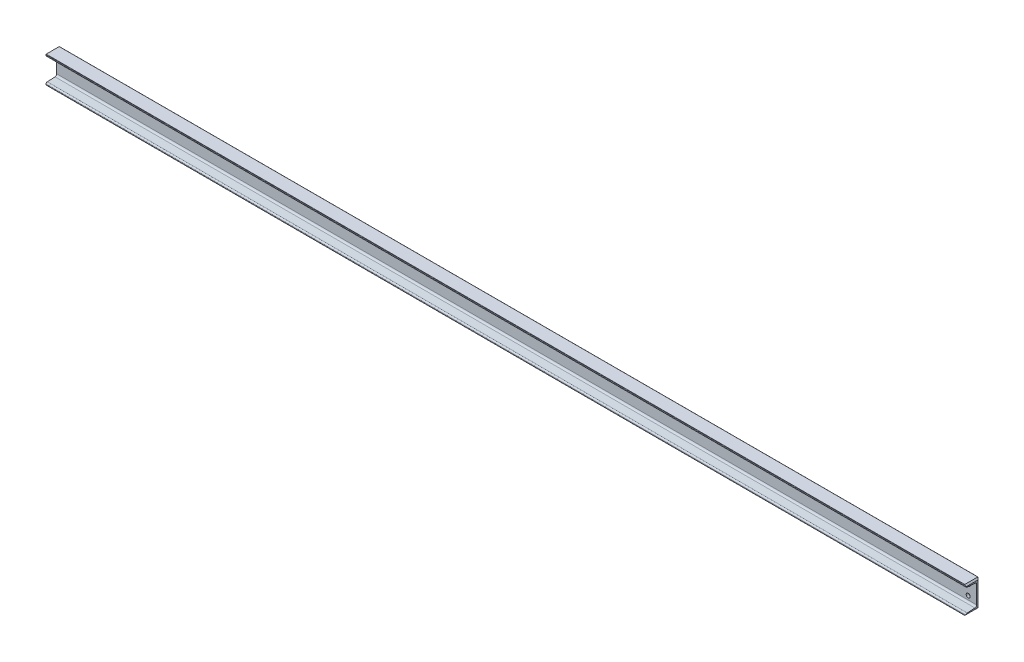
ISO-10303-21;
HEADER;
FILE_DESCRIPTION(('STEP AP214'),'2;1');
FILE_NAME('part.step','',(''),(''),'','','');
FILE_SCHEMA(('AUTOMOTIVE_DESIGN { 1 0 10303 214 1 1 1 1 }'));
ENDSEC;
DATA;
#1=APPLICATION_CONTEXT('core data for automotive mechanical design processes');
#2=APPLICATION_PROTOCOL_DEFINITION('international standard','automotive_design',2000,#1);
#3=PRODUCT_CONTEXT('',#1,'mechanical');
#4=PRODUCT('Part','Part','',(#3));
#5=PRODUCT_RELATED_PRODUCT_CATEGORY('part','',(#4));
#6=PRODUCT_DEFINITION_FORMATION('','',#4);
#7=PRODUCT_DEFINITION_CONTEXT('part definition',#1,'design');
#8=PRODUCT_DEFINITION('design','',#6,#7);
#9=PRODUCT_DEFINITION_SHAPE('','',#8);
#10=(LENGTH_UNIT() NAMED_UNIT(*) SI_UNIT(.MILLI.,.METRE.));
#11=(NAMED_UNIT(*) PLANE_ANGLE_UNIT() SI_UNIT($,.RADIAN.));
#12=(NAMED_UNIT(*) SI_UNIT($,.STERADIAN.) SOLID_ANGLE_UNIT());
#13=UNCERTAINTY_MEASURE_WITH_UNIT(LENGTH_MEASURE(1.E-05),#10,'distance_accuracy_value','');
#14=(GEOMETRIC_REPRESENTATION_CONTEXT(3) GLOBAL_UNCERTAINTY_ASSIGNED_CONTEXT((#13)) GLOBAL_UNIT_ASSIGNED_CONTEXT((#10,
#11,#12)) REPRESENTATION_CONTEXT('',''));
#15=CARTESIAN_POINT('',(0.,0.,0.));
#16=DIRECTION('',(0.,0.,1.));
#17=DIRECTION('',(1.,0.,0.));
#18=AXIS2_PLACEMENT_3D('',#15,#16,#17);
#19=CARTESIAN_POINT('',(0.,0.,30.));
#20=DIRECTION('',(0.,0.,1.));
#21=DIRECTION('',(1.,0.,0.));
#22=AXIS2_PLACEMENT_3D('',#19,#20,#21);
#23=PLANE('',#22);
#24=DIRECTION('',(-0.7071067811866,-0.707106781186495,0.));
#25=VECTOR('',#24,1.);
#26=CARTESIAN_POINT('',(528.499999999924,-528.500000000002,30.));
#27=LINE('',#26,#25);
#28=CARTESIAN_POINT('',(1027.5,-29.4999999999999,30.));
#29=VERTEX_POINT('',#28);
#30=CARTESIAN_POINT('',(1029.09397946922,-27.906020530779,30.));
#31=VERTEX_POINT('',#30);
#32=EDGE_CURVE('E210',#29,#31,#27,.F.);
#33=ORIENTED_EDGE('',*,*,#32,.T.);
#34=DIRECTION('',(1.,0.,0.));
#35=VECTOR('',#34,1.);
#36=CARTESIAN_POINT('',(-1030.,-27.9060205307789,30.));
#37=LINE('',#36,#35);
#38=CARTESIAN_POINT('',(-1030.,-27.9060205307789,30.));
#39=VERTEX_POINT('',#38);
#40=EDGE_CURVE('E258',#31,#39,#37,.F.);
#41=ORIENTED_EDGE('',*,*,#40,.T.);
#42=DIRECTION('',(0.,-1.,0.));
#43=VECTOR('',#42,1.);
#44=CARTESIAN_POINT('',(-1030.,30.,30.));
#45=LINE('',#44,#43);
#46=CARTESIAN_POINT('',(-1030.,-29.5,30.));
#47=VERTEX_POINT('',#46);
#48=EDGE_CURVE('E305',#39,#47,#45,.T.);
#49=ORIENTED_EDGE('',*,*,#48,.T.);
#50=DIRECTION('',(1.,0.,0.));
#51=VECTOR('',#50,1.);
#52=CARTESIAN_POINT('',(0.,-29.5,30.));
#53=LINE('',#52,#51);
#54=EDGE_CURVE('E216',#47,#29,#53,.T.);
#55=ORIENTED_EDGE('',*,*,#54,.T.);
#56=EDGE_LOOP('',(#33,#41,#49,#55));
#57=FACE_BOUND('',#56,.T.);
#58=ADVANCED_FACE('F35',(#57),#23,.T.);
#59=CARTESIAN_POINT('',(1030.,30.,0.));
#60=DIRECTION('',(0.,1.,0.));
#61=DIRECTION('',(0.,0.,1.));
#62=AXIS2_PLACEMENT_3D('',#59,#60,#61);
#63=PLANE('',#62);
#64=DIRECTION('',(0.,0.,1.));
#65=VECTOR('',#64,1.);
#66=CARTESIAN_POINT('',(-1030.,30.,0.));
#67=LINE('',#66,#65);
#68=CARTESIAN_POINT('',(-1030.,30.,0.500000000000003));
#69=VERTEX_POINT('',#68);
#70=CARTESIAN_POINT('',(-1030.,30.,29.5));
#71=VERTEX_POINT('',#70);
#72=EDGE_CURVE('E195',#69,#71,#67,.T.);
#73=ORIENTED_EDGE('',*,*,#72,.T.);
#74=DIRECTION('',(-1.,0.,0.));
#75=VECTOR('',#74,1.);
#76=CARTESIAN_POINT('',(1030.,30.,29.5));
#77=LINE('',#76,#75);
#78=CARTESIAN_POINT('',(1027.,30.,29.5));
#79=VERTEX_POINT('',#78);
#80=EDGE_CURVE('E243',#71,#79,#77,.F.);
#81=ORIENTED_EDGE('',*,*,#80,.T.);
#82=DIRECTION('',(0.,0.,-1.));
#83=VECTOR('',#82,1.);
#84=CARTESIAN_POINT('',(1027.,30.,0.));
#85=LINE('',#84,#83);
#86=CARTESIAN_POINT('',(1027.,30.,0.500000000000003));
#87=VERTEX_POINT('',#86);
#88=EDGE_CURVE('E204',#79,#87,#85,.T.);
#89=ORIENTED_EDGE('',*,*,#88,.T.);
#90=DIRECTION('',(-1.,0.,0.));
#91=VECTOR('',#90,1.);
#92=CARTESIAN_POINT('',(-1030.,30.,0.500000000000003));
#93=LINE('',#92,#91);
#94=EDGE_CURVE('E240',#87,#69,#93,.T.);
#95=ORIENTED_EDGE('',*,*,#94,.T.);
#96=EDGE_LOOP('',(#73,#81,#89,#95));
#97=FACE_BOUND('',#96,.T.);
#98=ADVANCED_FACE('F333',(#97),#63,.T.);
#99=CARTESIAN_POINT('',(1030.,-30.,0.));
#100=DIRECTION('',(1.,0.,0.));
#101=DIRECTION('',(0.,0.,-1.));
#102=AXIS2_PLACEMENT_3D('',#99,#100,#101);
#103=PLANE('',#102);
#104=DIRECTION('',(0.,-1.,0.));
#105=VECTOR('',#104,1.);
#106=CARTESIAN_POINT('',(1030.,23.8013401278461,6.));
#107=LINE('',#106,#105);
#108=CARTESIAN_POINT('',(1030.,20.0054818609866,6.));
#109=VERTEX_POINT('',#108);
#110=CARTESIAN_POINT('',(1030.,-20.0054818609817,6.));
#111=VERTEX_POINT('',#110);
#112=EDGE_CURVE('E297',#109,#111,#107,.T.);
#113=ORIENTED_EDGE('',*,*,#112,.T.);
#114=CARTESIAN_POINT('',(1030.,-20.0054818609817,10.));
#115=DIRECTION('',(1.,0.,0.));
#116=DIRECTION('',(0.,0.,-1.));
#117=AXIS2_PLACEMENT_3D('',#114,#115,#116);
#118=CIRCLE('',#117,4.);
#119=CARTESIAN_POINT('',(1030.,-24.,9.79065617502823));
#120=VERTEX_POINT('',#119);
#121=EDGE_CURVE('E292',#111,#120,#118,.F.);
#122=ORIENTED_EDGE('',*,*,#121,.T.);
#123=DIRECTION('',(0.,0.0523359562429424,-0.998629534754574));
#124=VECTOR('',#123,1.);
#125=CARTESIAN_POINT('',(1030.,-23.8013401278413,6.));
#126=LINE('',#125,#124);
#127=CARTESIAN_POINT('',(1030.,-24.9101319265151,27.1570078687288));
#128=VERTEX_POINT('',#127);
#129=EDGE_CURVE('E295',#120,#128,#126,.F.);
#130=ORIENTED_EDGE('',*,*,#129,.T.);
#131=CARTESIAN_POINT('',(1030.,-27.9060205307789,27.));
#132=DIRECTION('',(1.,0.,0.));
#133=DIRECTION('',(0.,0.,-1.));
#134=AXIS2_PLACEMENT_3D('',#131,#132,#133);
#135=CIRCLE('',#134,3.);
#136=CARTESIAN_POINT('',(1030.,-26.9999999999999,29.8599172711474));
#137=VERTEX_POINT('',#136);
#138=EDGE_CURVE('E174',#128,#137,#135,.T.);
#139=ORIENTED_EDGE('',*,*,#138,.T.);
#140=DIRECTION('',(0.,0.,-1.));
#141=VECTOR('',#140,1.);
#142=CARTESIAN_POINT('',(1030.,-26.9999999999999,0.));
#143=LINE('',#142,#141);
#144=CARTESIAN_POINT('',(1030.,-26.9999999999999,3.00000000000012));
#145=VERTEX_POINT('',#144);
#146=EDGE_CURVE('E165',#137,#145,#143,.T.);
#147=ORIENTED_EDGE('',*,*,#146,.T.);
#148=DIRECTION('',(0.,1.,0.));
#149=VECTOR('',#148,1.);
#150=CARTESIAN_POINT('',(1030.,30.,3.00000000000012));
#151=LINE('',#150,#149);
#152=CARTESIAN_POINT('',(1030.,26.9999999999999,3.00000000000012));
#153=VERTEX_POINT('',#152);
#154=EDGE_CURVE('E171',#145,#153,#151,.T.);
#155=ORIENTED_EDGE('',*,*,#154,.T.);
#156=DIRECTION('',(0.,0.,1.));
#157=VECTOR('',#156,1.);
#158=CARTESIAN_POINT('',(1030.,26.9999999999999,0.));
#159=LINE('',#158,#157);
#160=CARTESIAN_POINT('',(1030.,26.9999999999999,29.8599172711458));
#161=VERTEX_POINT('',#160);
#162=EDGE_CURVE('E177',#153,#161,#159,.T.);
#163=ORIENTED_EDGE('',*,*,#162,.T.);
#164=CARTESIAN_POINT('',(1030.,27.9060205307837,27.));
#165=DIRECTION('',(1.,0.,0.));
#166=DIRECTION('',(0.,0.,-1.));
#167=AXIS2_PLACEMENT_3D('',#164,#165,#166);
#168=CIRCLE('',#167,3.);
#169=CARTESIAN_POINT('',(1030.,24.91013192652,27.1570078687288));
#170=VERTEX_POINT('',#169);
#171=EDGE_CURVE('E269',#161,#170,#168,.T.);
#172=ORIENTED_EDGE('',*,*,#171,.T.);
#173=DIRECTION('',(0.,0.0523359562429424,0.998629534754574));
#174=VECTOR('',#173,1.);
#175=CARTESIAN_POINT('',(1030.,23.8013401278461,6.));
#176=LINE('',#175,#174);
#177=CARTESIAN_POINT('',(1030.,24.0000000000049,9.79065617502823));
#178=VERTEX_POINT('',#177);
#179=EDGE_CURVE('E198',#170,#178,#176,.F.);
#180=ORIENTED_EDGE('',*,*,#179,.T.);
#181=CARTESIAN_POINT('',(1030.,20.0054818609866,10.));
#182=DIRECTION('',(1.,0.,0.));
#183=DIRECTION('',(0.,0.,-1.));
#184=AXIS2_PLACEMENT_3D('',#181,#182,#183);
#185=CIRCLE('',#184,4.);
#186=EDGE_CURVE('E11',#178,#109,#185,.F.);
#187=ORIENTED_EDGE('',*,*,#186,.T.);
#188=EDGE_LOOP('',(#113,#122,#130,#139,#147,#155,#163,#172,#180,#187));
#189=FACE_BOUND('',#188,.T.);
#190=ADVANCED_FACE('F168',(#189),#103,.T.);
#191=CARTESIAN_POINT('',(-1030.,-30.,0.));
#192=DIRECTION('',(0.,-1.,0.));
#193=DIRECTION('',(0.,0.,-1.));
#194=AXIS2_PLACEMENT_3D('',#191,#192,#193);
#195=PLANE('',#194);
#196=DIRECTION('',(0.,0.,1.));
#197=VECTOR('',#196,1.);
#198=CARTESIAN_POINT('',(1027.,-30.,0.));
#199=LINE('',#198,#197);
#200=CARTESIAN_POINT('',(1027.,-30.,0.500000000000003));
#201=VERTEX_POINT('',#200);
#202=CARTESIAN_POINT('',(1027.,-30.,29.5));
#203=VERTEX_POINT('',#202);
#204=EDGE_CURVE('E207',#201,#203,#199,.T.);
#205=ORIENTED_EDGE('',*,*,#204,.T.);
#206=DIRECTION('',(1.,0.,0.));
#207=VECTOR('',#206,1.);
#208=CARTESIAN_POINT('',(-1030.,-30.,29.5));
#209=LINE('',#208,#207);
#210=CARTESIAN_POINT('',(-1030.,-30.,29.5));
#211=VERTEX_POINT('',#210);
#212=EDGE_CURVE('E226',#203,#211,#209,.F.);
#213=ORIENTED_EDGE('',*,*,#212,.T.);
#214=DIRECTION('',(0.,0.,1.));
#215=VECTOR('',#214,1.);
#216=CARTESIAN_POINT('',(-1030.,-30.,0.));
#217=LINE('',#216,#215);
#218=CARTESIAN_POINT('',(-1030.,-30.,0.500000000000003));
#219=VERTEX_POINT('',#218);
#220=EDGE_CURVE('E192',#219,#211,#217,.T.);
#221=ORIENTED_EDGE('',*,*,#220,.F.);
#222=DIRECTION('',(1.,0.,0.));
#223=VECTOR('',#222,1.);
#224=CARTESIAN_POINT('',(1027.,-30.,0.500000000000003));
#225=LINE('',#224,#223);
#226=EDGE_CURVE('E223',#219,#201,#225,.T.);
#227=ORIENTED_EDGE('',*,*,#226,.T.);
#228=EDGE_LOOP('',(#205,#213,#221,#227));
#229=FACE_BOUND('',#228,.T.);
#230=ADVANCED_FACE('F361',(#229),#195,.T.);
#231=CARTESIAN_POINT('',(-1030.,30.,0.));
#232=DIRECTION('',(-1.,0.,0.));
#233=DIRECTION('',(0.,0.,1.));
#234=AXIS2_PLACEMENT_3D('',#231,#232,#233);
#235=PLANE('',#234);
#236=ORIENTED_EDGE('',*,*,#48,.F.);
#237=CARTESIAN_POINT('',(-1030.,-27.9060205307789,27.));
#238=DIRECTION('',(-1.,0.,0.));
#239=DIRECTION('',(0.,0.,1.));
#240=AXIS2_PLACEMENT_3D('',#237,#238,#239);
#241=CIRCLE('',#240,3.);
#242=CARTESIAN_POINT('',(-1030.,-24.9101319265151,27.1570078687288));
#243=VERTEX_POINT('',#242);
#244=EDGE_CURVE('E263',#39,#243,#241,.T.);
#245=ORIENTED_EDGE('',*,*,#244,.T.);
#246=DIRECTION('',(0.,0.0523359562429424,-0.998629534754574));
#247=VECTOR('',#246,1.);
#248=CARTESIAN_POINT('',(-1030.,-23.3403900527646,-2.79545138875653));
#249=LINE('',#248,#247);
#250=CARTESIAN_POINT('',(-1030.,-24.,9.79065617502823));
#251=VERTEX_POINT('',#250);
#252=EDGE_CURVE('E312',#251,#243,#249,.F.);
#253=ORIENTED_EDGE('',*,*,#252,.F.);
#254=CARTESIAN_POINT('',(-1030.,-20.0054818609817,10.));
#255=DIRECTION('',(-1.,0.,0.));
#256=DIRECTION('',(0.,0.,1.));
#257=AXIS2_PLACEMENT_3D('',#254,#255,#256);
#258=CIRCLE('',#257,4.);
#259=CARTESIAN_POINT('',(-1030.,-20.0054818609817,6.));
#260=VERTEX_POINT('',#259);
#261=EDGE_CURVE('E290',#251,#260,#258,.F.);
#262=ORIENTED_EDGE('',*,*,#261,.T.);
#263=DIRECTION('',(0.,-1.,0.));
#264=VECTOR('',#263,1.);
#265=CARTESIAN_POINT('',(-1030.,23.8013401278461,6.));
#266=LINE('',#265,#264);
#267=CARTESIAN_POINT('',(-1030.,20.0054818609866,6.));
#268=VERTEX_POINT('',#267);
#269=EDGE_CURVE('E311',#268,#260,#266,.T.);
#270=ORIENTED_EDGE('',*,*,#269,.F.);
#271=CARTESIAN_POINT('',(-1030.,20.0054818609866,10.));
#272=DIRECTION('',(-1.,0.,0.));
#273=DIRECTION('',(0.,0.,1.));
#274=AXIS2_PLACEMENT_3D('',#271,#272,#273);
#275=CIRCLE('',#274,4.);
#276=CARTESIAN_POINT('',(-1030.,24.0000000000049,9.79065617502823));
#277=VERTEX_POINT('',#276);
#278=EDGE_CURVE('E43',#268,#277,#275,.F.);
#279=ORIENTED_EDGE('',*,*,#278,.T.);
#280=DIRECTION('',(0.,0.0523359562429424,0.998629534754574));
#281=VECTOR('',#280,1.);
#282=CARTESIAN_POINT('',(-1030.,23.5047331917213,0.340402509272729));
#283=LINE('',#282,#281);
#284=CARTESIAN_POINT('',(-1030.,24.91013192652,27.1570078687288));
#285=VERTEX_POINT('',#284);
#286=EDGE_CURVE('E316',#285,#277,#283,.F.);
#287=ORIENTED_EDGE('',*,*,#286,.F.);
#288=CARTESIAN_POINT('',(-1030.,27.9060205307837,27.));
#289=DIRECTION('',(-1.,0.,0.));
#290=DIRECTION('',(0.,0.,1.));
#291=AXIS2_PLACEMENT_3D('',#288,#289,#290);
#292=CIRCLE('',#291,3.);
#293=CARTESIAN_POINT('',(-1030.,27.9060205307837,30.));
#294=VERTEX_POINT('',#293);
#295=EDGE_CURVE('E261',#285,#294,#292,.T.);
#296=ORIENTED_EDGE('',*,*,#295,.T.);
#297=CARTESIAN_POINT('',(-1030.,29.5,30.));
#298=VERTEX_POINT('',#297);
#299=EDGE_CURVE('E326',#298,#294,#45,.T.);
#300=ORIENTED_EDGE('',*,*,#299,.F.);
#301=CARTESIAN_POINT('',(-1030.,29.5,29.5));
#302=DIRECTION('',(-1.,0.,0.));
#303=DIRECTION('',(0.,0.,1.));
#304=AXIS2_PLACEMENT_3D('',#301,#302,#303);
#305=CIRCLE('',#304,0.5);
#306=EDGE_CURVE('E232',#298,#71,#305,.T.);
#307=ORIENTED_EDGE('',*,*,#306,.T.);
#308=ORIENTED_EDGE('',*,*,#72,.F.);
#309=CARTESIAN_POINT('',(-1030.,29.5,0.500000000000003));
#310=DIRECTION('',(-1.,0.,0.));
#311=DIRECTION('',(0.,0.,1.));
#312=AXIS2_PLACEMENT_3D('',#309,#310,#311);
#313=CIRCLE('',#312,0.5);
#314=CARTESIAN_POINT('',(-1030.,29.5,0.));
#315=VERTEX_POINT('',#314);
#316=EDGE_CURVE('E228',#69,#315,#313,.T.);
#317=ORIENTED_EDGE('',*,*,#316,.T.);
#318=DIRECTION('',(0.,-1.,0.));
#319=VECTOR('',#318,1.);
#320=CARTESIAN_POINT('',(-1030.,30.,0.));
#321=LINE('',#320,#319);
#322=CARTESIAN_POINT('',(-1030.,-29.5,0.));
#323=VERTEX_POINT('',#322);
#324=EDGE_CURVE('E323',#315,#323,#321,.T.);
#325=ORIENTED_EDGE('',*,*,#324,.T.);
#326=CARTESIAN_POINT('',(-1030.,-29.5,0.500000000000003));
#327=DIRECTION('',(-1.,0.,0.));
#328=DIRECTION('',(0.,0.,1.));
#329=AXIS2_PLACEMENT_3D('',#326,#327,#328);
#330=CIRCLE('',#329,0.5);
#331=EDGE_CURVE('E230',#323,#219,#330,.T.);
#332=ORIENTED_EDGE('',*,*,#331,.T.);
#333=ORIENTED_EDGE('',*,*,#220,.T.);
#334=CARTESIAN_POINT('',(-1030.,-29.5,29.5));
#335=DIRECTION('',(-1.,0.,0.));
#336=DIRECTION('',(0.,0.,1.));
#337=AXIS2_PLACEMENT_3D('',#334,#335,#336);
#338=CIRCLE('',#337,0.5);
#339=EDGE_CURVE('E234',#211,#47,#338,.T.);
#340=ORIENTED_EDGE('',*,*,#339,.T.);
#341=EDGE_LOOP('',(#236,#245,#253,#262,#270,#279,#287,#296,#300,#307,#308,#317,#325,#332,#333,#340));
#342=FACE_BOUND('',#341,.T.);
#343=ADVANCED_FACE('F310',(#342),#235,.T.);
#344=CARTESIAN_POINT('',(0.,0.,0.));
#345=DIRECTION('',(0.,0.,1.));
#346=DIRECTION('',(1.,0.,0.));
#347=AXIS2_PLACEMENT_3D('',#344,#345,#346);
#348=PLANE('',#347);
#349=CARTESIAN_POINT('',(1011.,-11.25,0.));
#350=DIRECTION('',(0.,0.,1.));
#351=DIRECTION('',(1.,0.,0.));
#352=AXIS2_PLACEMENT_3D('',#349,#350,#351);
#353=CIRCLE('',#352,4.49999999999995);
#354=CARTESIAN_POINT('',(1015.5,-11.25,0.));
#355=VERTEX_POINT('',#354);
#356=EDGE_CURVE('E566',#355,#355,#353,.T.);
#357=ORIENTED_EDGE('',*,*,#356,.T.);
#358=EDGE_LOOP('',(#357));
#359=FACE_BOUND('',#358,.T.);
#360=CARTESIAN_POINT('',(1011.,11.25,0.));
#361=DIRECTION('',(0.,0.,1.));
#362=DIRECTION('',(1.,0.,0.));
#363=AXIS2_PLACEMENT_3D('',#360,#361,#362);
#364=CIRCLE('',#363,4.49999999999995);
#365=CARTESIAN_POINT('',(1015.5,11.25,0.));
#366=VERTEX_POINT('',#365);
#367=EDGE_CURVE('E319',#366,#366,#364,.T.);
#368=ORIENTED_EDGE('',*,*,#367,.T.);
#369=EDGE_LOOP('',(#368));
#370=FACE_BOUND('',#369,.T.);
#371=DIRECTION('',(0.,-1.,0.));
#372=VECTOR('',#371,1.);
#373=CARTESIAN_POINT('',(1027.,-30.,0.));
#374=LINE('',#373,#372);
#375=CARTESIAN_POINT('',(1027.,29.5,0.));
#376=VERTEX_POINT('',#375);
#377=CARTESIAN_POINT('',(1027.,-29.5,0.));
#378=VERTEX_POINT('',#377);
#379=EDGE_CURVE('E213',#376,#378,#374,.T.);
#380=ORIENTED_EDGE('',*,*,#379,.T.);
#381=DIRECTION('',(1.,0.,0.));
#382=VECTOR('',#381,1.);
#383=CARTESIAN_POINT('',(-1030.,-29.5,0.));
#384=LINE('',#383,#382);
#385=EDGE_CURVE('E256',#378,#323,#384,.F.);
#386=ORIENTED_EDGE('',*,*,#385,.T.);
#387=ORIENTED_EDGE('',*,*,#324,.F.);
#388=DIRECTION('',(-1.,0.,0.));
#389=VECTOR('',#388,1.);
#390=CARTESIAN_POINT('',(1027.,29.5,0.));
#391=LINE('',#390,#389);
#392=EDGE_CURVE('E254',#315,#376,#391,.F.);
#393=ORIENTED_EDGE('',*,*,#392,.T.);
#394=EDGE_LOOP('',(#380,#386,#387,#393));
#395=FACE_BOUND('',#394,.T.);
#396=ADVANCED_FACE('F352',(#359,#370,#395),#348,.F.);
#397=ORIENTED_EDGE('',*,*,#299,.T.);
#398=DIRECTION('',(1.,0.,0.));
#399=VECTOR('',#398,1.);
#400=CARTESIAN_POINT('',(1030.,27.9060205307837,30.));
#401=LINE('',#400,#399);
#402=CARTESIAN_POINT('',(1029.09397946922,27.9060205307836,30.));
#403=VERTEX_POINT('',#402);
#404=EDGE_CURVE('E277',#294,#403,#401,.T.);
#405=ORIENTED_EDGE('',*,*,#404,.T.);
#406=DIRECTION('',(0.707106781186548,-0.707106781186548,0.));
#407=VECTOR('',#406,1.);
#408=CARTESIAN_POINT('',(528.5,528.5,30.));
#409=LINE('',#408,#407);
#410=CARTESIAN_POINT('',(1027.5,29.4999999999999,30.));
#411=VERTEX_POINT('',#410);
#412=EDGE_CURVE('E202',#403,#411,#409,.F.);
#413=ORIENTED_EDGE('',*,*,#412,.T.);
#414=DIRECTION('',(-1.,0.,0.));
#415=VECTOR('',#414,1.);
#416=CARTESIAN_POINT('',(0.,29.5,30.));
#417=LINE('',#416,#415);
#418=EDGE_CURVE('E237',#411,#298,#417,.T.);
#419=ORIENTED_EDGE('',*,*,#418,.T.);
#420=EDGE_LOOP('',(#397,#405,#413,#419));
#421=FACE_BOUND('',#420,.T.);
#422=ADVANCED_FACE('F383',(#421),#23,.T.);
#423=CARTESIAN_POINT('',(1030.,-23.8013401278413,6.));
#424=DIRECTION('',(0.,0.998629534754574,0.0523359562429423));
#425=DIRECTION('',(0.,-0.0523359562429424,0.998629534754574));
#426=AXIS2_PLACEMENT_3D('',#423,#424,#425);
#427=PLANE('',#426);
#428=ORIENTED_EDGE('',*,*,#129,.F.);
#429=DIRECTION('',(-1.,0.,0.));
#430=VECTOR('',#429,1.);
#431=CARTESIAN_POINT('',(-1030.,-24.,9.79065617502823));
#432=LINE('',#431,#430);
#433=EDGE_CURVE('E281',#120,#251,#432,.T.);
#434=ORIENTED_EDGE('',*,*,#433,.T.);
#435=ORIENTED_EDGE('',*,*,#252,.T.);
#436=DIRECTION('',(-1.,0.,0.));
#437=VECTOR('',#436,1.);
#438=CARTESIAN_POINT('',(1030.,-24.9101319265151,27.1570078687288));
#439=LINE('',#438,#437);
#440=EDGE_CURVE('E266',#243,#128,#439,.F.);
#441=ORIENTED_EDGE('',*,*,#440,.T.);
#442=EDGE_LOOP('',(#428,#434,#435,#441));
#443=FACE_BOUND('',#442,.T.);
#444=ADVANCED_FACE('F302',(#443),#427,.T.);
#445=CARTESIAN_POINT('',(1030.,23.8013401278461,6.));
#446=DIRECTION('',(0.,0.,-1.));
#447=DIRECTION('',(-1.,0.,0.));
#448=AXIS2_PLACEMENT_3D('',#445,#446,#447);
#449=PLANE('',#448);
#450=CARTESIAN_POINT('',(1011.,-11.25,6.));
#451=DIRECTION('',(0.,0.,1.));
#452=DIRECTION('',(1.,0.,0.));
#453=AXIS2_PLACEMENT_3D('',#450,#451,#452);
#454=CIRCLE('',#453,4.49999999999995);
#455=CARTESIAN_POINT('',(1015.5,-11.25,6.));
#456=VERTEX_POINT('',#455);
#457=EDGE_CURVE('E186',#456,#456,#454,.T.);
#458=ORIENTED_EDGE('',*,*,#457,.F.);
#459=EDGE_LOOP('',(#458));
#460=FACE_BOUND('',#459,.T.);
#461=CARTESIAN_POINT('',(1011.,11.25,6.));
#462=DIRECTION('',(0.,0.,1.));
#463=DIRECTION('',(1.,0.,0.));
#464=AXIS2_PLACEMENT_3D('',#461,#462,#463);
#465=CIRCLE('',#464,4.49999999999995);
#466=CARTESIAN_POINT('',(1015.5,11.25,6.));
#467=VERTEX_POINT('',#466);
#468=EDGE_CURVE('E570',#467,#467,#465,.T.);
#469=ORIENTED_EDGE('',*,*,#468,.F.);
#470=EDGE_LOOP('',(#469));
#471=FACE_BOUND('',#470,.T.);
#472=ORIENTED_EDGE('',*,*,#269,.T.);
#473=DIRECTION('',(1.,0.,0.));
#474=VECTOR('',#473,1.);
#475=CARTESIAN_POINT('',(1030.,-20.0054818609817,6.));
#476=LINE('',#475,#474);
#477=EDGE_CURVE('E287',#260,#111,#476,.T.);
#478=ORIENTED_EDGE('',*,*,#477,.T.);
#479=ORIENTED_EDGE('',*,*,#112,.F.);
#480=DIRECTION('',(1.,0.,0.));
#481=VECTOR('',#480,1.);
#482=CARTESIAN_POINT('',(-1030.,20.0054818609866,6.));
#483=LINE('',#482,#481);
#484=EDGE_CURVE('E284',#109,#268,#483,.F.);
#485=ORIENTED_EDGE('',*,*,#484,.T.);
#486=EDGE_LOOP('',(#472,#478,#479,#485));
#487=FACE_BOUND('',#486,.T.);
#488=ADVANCED_FACE('F314',(#460,#471,#487),#449,.F.);
#489=CARTESIAN_POINT('',(1030.,23.8013401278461,6.));
#490=DIRECTION('',(0.,-0.998629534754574,0.0523359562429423));
#491=DIRECTION('',(0.,-0.0523359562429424,-0.998629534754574));
#492=AXIS2_PLACEMENT_3D('',#489,#490,#491);
#493=PLANE('',#492);
#494=ORIENTED_EDGE('',*,*,#286,.T.);
#495=DIRECTION('',(-1.,0.,0.));
#496=VECTOR('',#495,1.);
#497=CARTESIAN_POINT('',(1030.,24.0000000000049,9.79065617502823));
#498=LINE('',#497,#496);
#499=EDGE_CURVE('E56',#277,#178,#498,.F.);
#500=ORIENTED_EDGE('',*,*,#499,.T.);
#501=ORIENTED_EDGE('',*,*,#179,.F.);
#502=DIRECTION('',(-1.,0.,0.));
#503=VECTOR('',#502,1.);
#504=CARTESIAN_POINT('',(-1030.,24.91013192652,27.1570078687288));
#505=LINE('',#504,#503);
#506=EDGE_CURVE('E274',#170,#285,#505,.T.);
#507=ORIENTED_EDGE('',*,*,#506,.T.);
#508=EDGE_LOOP('',(#494,#500,#501,#507));
#509=FACE_BOUND('',#508,.T.);
#510=ADVANCED_FACE('F403',(#509),#493,.T.);
#511=CARTESIAN_POINT('',(1011.,11.25,6.));
#512=DIRECTION('',(0.,0.,1.));
#513=DIRECTION('',(1.,0.,0.));
#514=AXIS2_PLACEMENT_3D('',#511,#512,#513);
#515=CYLINDRICAL_SURFACE('',#514,4.49999999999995);
#516=ORIENTED_EDGE('',*,*,#367,.F.);
#517=EDGE_LOOP('',(#516));
#518=FACE_BOUND('',#517,.T.);
#519=ORIENTED_EDGE('',*,*,#468,.T.);
#520=EDGE_LOOP('',(#519));
#521=FACE_BOUND('',#520,.T.);
#522=ADVANCED_FACE('F461',(#518,#521),#515,.F.);
#523=CARTESIAN_POINT('',(1011.,-11.25,6.));
#524=DIRECTION('',(0.,0.,1.));
#525=DIRECTION('',(1.,0.,0.));
#526=AXIS2_PLACEMENT_3D('',#523,#524,#525);
#527=CYLINDRICAL_SURFACE('',#526,4.49999999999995);
#528=ORIENTED_EDGE('',*,*,#356,.F.);
#529=EDGE_LOOP('',(#528));
#530=FACE_BOUND('',#529,.T.);
#531=ORIENTED_EDGE('',*,*,#457,.T.);
#532=EDGE_LOOP('',(#531));
#533=FACE_BOUND('',#532,.T.);
#534=ADVANCED_FACE('F471',(#530,#533),#527,.F.);
#535=CARTESIAN_POINT('',(1027.,-30.,0.));
#536=DIRECTION('',(-0.707106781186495,0.7071067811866,0.));
#537=DIRECTION('',(0.,0.,1.));
#538=AXIS2_PLACEMENT_3D('',#535,#536,#537);
#539=PLANE('',#538);
#540=ORIENTED_EDGE('',*,*,#146,.F.);
#541=CARTESIAN_POINT('',(1029.09397946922,-27.9060205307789,27.));
#542=DIRECTION('',(-0.707106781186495,0.7071067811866,0.));
#543=DIRECTION('',(-0.7071067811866,-0.707106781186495,0.));
#544=AXIS2_PLACEMENT_3D('',#541,#542,#543);
#545=ELLIPSE('',#544,4.2426406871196,3.);
#546=EDGE_CURVE('E272',#137,#31,#545,.F.);
#547=ORIENTED_EDGE('',*,*,#546,.T.);
#548=ORIENTED_EDGE('',*,*,#32,.F.);
#549=CARTESIAN_POINT('',(1027.5,-29.5,29.5));
#550=DIRECTION('',(-0.707106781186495,0.7071067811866,0.));
#551=DIRECTION('',(0.7071067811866,0.707106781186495,0.));
#552=AXIS2_PLACEMENT_3D('',#549,#550,#551);
#553=ELLIPSE('',#552,0.7071067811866,0.5);
#554=EDGE_CURVE('E221',#29,#203,#553,.F.);
#555=ORIENTED_EDGE('',*,*,#554,.T.);
#556=ORIENTED_EDGE('',*,*,#204,.F.);
#557=CARTESIAN_POINT('',(1027.5,-29.5,0.500000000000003));
#558=DIRECTION('',(-0.707106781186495,0.7071067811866,0.));
#559=DIRECTION('',(-0.7071067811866,-0.707106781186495,0.));
#560=AXIS2_PLACEMENT_3D('',#557,#558,#559);
#561=ELLIPSE('',#560,0.7071067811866,0.5);
#562=CARTESIAN_POINT('',(1027.14644660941,-29.8535533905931,0.146446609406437));
#563=VERTEX_POINT('',#562);
#564=EDGE_CURVE('E183',#201,#563,#561,.F.);
#565=ORIENTED_EDGE('',*,*,#564,.T.);
#566=DIRECTION('',(0.577350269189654,0.577350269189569,0.577350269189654));
#567=VECTOR('',#566,1.);
#568=CARTESIAN_POINT('',(1029.,-27.9999999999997,2.00000000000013));
#569=LINE('',#568,#567);
#570=EDGE_CURVE('E180',#145,#563,#569,.F.);
#571=ORIENTED_EDGE('',*,*,#570,.F.);
#572=EDGE_LOOP('',(#540,#547,#548,#555,#556,#565,#571));
#573=FACE_BOUND('',#572,.T.);
#574=ADVANCED_FACE('F181',(#573),#539,.F.);
#575=CARTESIAN_POINT('',(1030.,-30.,3.00000000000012));
#576=DIRECTION('',(0.707106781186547,0.,-0.707106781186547));
#577=DIRECTION('',(0.,-1.,0.));
#578=AXIS2_PLACEMENT_3D('',#575,#576,#577);
#579=PLANE('',#578);
#580=ORIENTED_EDGE('',*,*,#570,.T.);
#581=CARTESIAN_POINT('',(1027.5,-29.5,0.500000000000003));
#582=DIRECTION('',(0.707106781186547,0.,-0.707106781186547));
#583=DIRECTION('',(-0.707106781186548,0.,-0.707106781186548));
#584=AXIS2_PLACEMENT_3D('',#581,#582,#583);
#585=ELLIPSE('',#584,0.707106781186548,0.5);
#586=EDGE_CURVE('E252',#563,#378,#585,.T.);
#587=ORIENTED_EDGE('',*,*,#586,.T.);
#588=ORIENTED_EDGE('',*,*,#379,.F.);
#589=CARTESIAN_POINT('',(1027.5,29.5,0.500000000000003));
#590=DIRECTION('',(0.707106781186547,0.,-0.707106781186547));
#591=DIRECTION('',(0.707106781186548,0.,0.707106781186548));
#592=AXIS2_PLACEMENT_3D('',#589,#590,#591);
#593=ELLIPSE('',#592,0.707106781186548,0.5);
#594=CARTESIAN_POINT('',(1027.14644660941,29.8535533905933,0.146446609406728));
#595=VERTEX_POINT('',#594);
#596=EDGE_CURVE('E250',#376,#595,#593,.T.);
#597=ORIENTED_EDGE('',*,*,#596,.T.);
#598=DIRECTION('',(-0.577350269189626,0.577350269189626,-0.577350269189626));
#599=VECTOR('',#598,1.);
#600=CARTESIAN_POINT('',(1049.,7.99999999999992,22.0000000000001));
#601=LINE('',#600,#599);
#602=EDGE_CURVE('E187',#153,#595,#601,.T.);
#603=ORIENTED_EDGE('',*,*,#602,.F.);
#604=ORIENTED_EDGE('',*,*,#154,.F.);
#605=EDGE_LOOP('',(#580,#587,#588,#597,#603,#604));
#606=FACE_BOUND('',#605,.T.);
#607=ADVANCED_FACE('F189',(#606),#579,.T.);
#608=CARTESIAN_POINT('',(1030.,26.9999999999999,0.));
#609=DIRECTION('',(-0.707106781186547,-0.707106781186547,0.));
#610=DIRECTION('',(0.,0.,1.));
#611=AXIS2_PLACEMENT_3D('',#608,#609,#610);
#612=PLANE('',#611);
#613=ORIENTED_EDGE('',*,*,#412,.F.);
#614=CARTESIAN_POINT('',(1029.09397946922,27.9060205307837,27.));
#615=DIRECTION('',(-0.707106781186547,-0.707106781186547,0.));
#616=DIRECTION('',(-0.707106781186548,0.707106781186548,0.));
#617=AXIS2_PLACEMENT_3D('',#614,#615,#616);
#618=ELLIPSE('',#617,4.24264068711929,3.);
#619=EDGE_CURVE('E279',#403,#161,#618,.F.);
#620=ORIENTED_EDGE('',*,*,#619,.T.);
#621=ORIENTED_EDGE('',*,*,#162,.F.);
#622=ORIENTED_EDGE('',*,*,#602,.T.);
#623=CARTESIAN_POINT('',(1027.5,29.5,0.500000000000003));
#624=DIRECTION('',(-0.707106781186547,-0.707106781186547,0.));
#625=DIRECTION('',(0.707106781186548,-0.707106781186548,0.));
#626=AXIS2_PLACEMENT_3D('',#623,#624,#625);
#627=ELLIPSE('',#626,0.707106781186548,0.5);
#628=EDGE_CURVE('E245',#595,#87,#627,.F.);
#629=ORIENTED_EDGE('',*,*,#628,.T.);
#630=ORIENTED_EDGE('',*,*,#88,.F.);
#631=CARTESIAN_POINT('',(1027.5,29.5,29.5));
#632=DIRECTION('',(-0.707106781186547,-0.707106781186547,0.));
#633=DIRECTION('',(-0.707106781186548,0.707106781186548,0.));
#634=AXIS2_PLACEMENT_3D('',#631,#632,#633);
#635=ELLIPSE('',#634,0.707106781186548,0.5);
#636=EDGE_CURVE('E247',#79,#411,#635,.F.);
#637=ORIENTED_EDGE('',*,*,#636,.T.);
#638=EDGE_LOOP('',(#613,#620,#621,#622,#629,#630,#637));
#639=FACE_BOUND('',#638,.T.);
#640=ADVANCED_FACE('F342',(#639),#612,.F.);
#641=CARTESIAN_POINT('',(0.,-29.5,29.5));
#642=DIRECTION('',(1.,0.,0.));
#643=DIRECTION('',(0.,0.,-1.));
#644=AXIS2_PLACEMENT_3D('',#641,#642,#643);
#645=CYLINDRICAL_SURFACE('',#644,0.5);
#646=ORIENTED_EDGE('',*,*,#339,.F.);
#647=ORIENTED_EDGE('',*,*,#212,.F.);
#648=ORIENTED_EDGE('',*,*,#554,.F.);
#649=ORIENTED_EDGE('',*,*,#54,.F.);
#650=EDGE_LOOP('',(#646,#647,#648,#649));
#651=FACE_BOUND('',#650,.T.);
#652=ADVANCED_FACE('F364',(#651),#645,.T.);
#653=CARTESIAN_POINT('',(0.,29.5,29.5));
#654=DIRECTION('',(-1.,0.,0.));
#655=DIRECTION('',(0.,0.,1.));
#656=AXIS2_PLACEMENT_3D('',#653,#654,#655);
#657=CYLINDRICAL_SURFACE('',#656,0.5);
#658=ORIENTED_EDGE('',*,*,#636,.F.);
#659=ORIENTED_EDGE('',*,*,#80,.F.);
#660=ORIENTED_EDGE('',*,*,#306,.F.);
#661=ORIENTED_EDGE('',*,*,#418,.F.);
#662=EDGE_LOOP('',(#658,#659,#660,#661));
#663=FACE_BOUND('',#662,.T.);
#664=ADVANCED_FACE('F338',(#663),#657,.T.);
#665=CARTESIAN_POINT('',(-1030.,-29.5,0.500000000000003));
#666=DIRECTION('',(-1.,0.,0.));
#667=DIRECTION('',(0.,0.,1.));
#668=AXIS2_PLACEMENT_3D('',#665,#666,#667);
#669=CYLINDRICAL_SURFACE('',#668,0.5);
#670=ORIENTED_EDGE('',*,*,#331,.F.);
#671=ORIENTED_EDGE('',*,*,#385,.F.);
#672=ORIENTED_EDGE('',*,*,#586,.F.);
#673=ORIENTED_EDGE('',*,*,#564,.F.);
#674=ORIENTED_EDGE('',*,*,#226,.F.);
#675=EDGE_LOOP('',(#670,#671,#672,#673,#674));
#676=FACE_BOUND('',#675,.T.);
#677=ADVANCED_FACE('F356',(#676),#669,.T.);
#678=CARTESIAN_POINT('',(1030.,29.5,0.500000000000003));
#679=DIRECTION('',(1.,0.,0.));
#680=DIRECTION('',(0.,0.,-1.));
#681=AXIS2_PLACEMENT_3D('',#678,#679,#680);
#682=CYLINDRICAL_SURFACE('',#681,0.5);
#683=ORIENTED_EDGE('',*,*,#596,.F.);
#684=ORIENTED_EDGE('',*,*,#392,.F.);
#685=ORIENTED_EDGE('',*,*,#316,.F.);
#686=ORIENTED_EDGE('',*,*,#94,.F.);
#687=ORIENTED_EDGE('',*,*,#628,.F.);
#688=EDGE_LOOP('',(#683,#684,#685,#686,#687));
#689=FACE_BOUND('',#688,.T.);
#690=ADVANCED_FACE('F347',(#689),#682,.T.);
#691=CARTESIAN_POINT('',(0.,-27.9060205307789,27.));
#692=DIRECTION('',(-1.,0.,0.));
#693=DIRECTION('',(0.,0.,1.));
#694=AXIS2_PLACEMENT_3D('',#691,#692,#693);
#695=CYLINDRICAL_SURFACE('',#694,3.);
#696=ORIENTED_EDGE('',*,*,#138,.F.);
#697=ORIENTED_EDGE('',*,*,#440,.F.);
#698=ORIENTED_EDGE('',*,*,#244,.F.);
#699=ORIENTED_EDGE('',*,*,#40,.F.);
#700=ORIENTED_EDGE('',*,*,#546,.F.);
#701=EDGE_LOOP('',(#696,#697,#698,#699,#700));
#702=FACE_BOUND('',#701,.T.);
#703=ADVANCED_FACE('F370',(#702),#695,.T.);
#704=CARTESIAN_POINT('',(1030.,27.9060205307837,27.));
#705=DIRECTION('',(-1.,0.,0.));
#706=DIRECTION('',(0.,0.,1.));
#707=AXIS2_PLACEMENT_3D('',#704,#705,#706);
#708=CYLINDRICAL_SURFACE('',#707,3.);
#709=ORIENTED_EDGE('',*,*,#619,.F.);
#710=ORIENTED_EDGE('',*,*,#404,.F.);
#711=ORIENTED_EDGE('',*,*,#295,.F.);
#712=ORIENTED_EDGE('',*,*,#506,.F.);
#713=ORIENTED_EDGE('',*,*,#171,.F.);
#714=EDGE_LOOP('',(#709,#710,#711,#712,#713));
#715=FACE_BOUND('',#714,.T.);
#716=ADVANCED_FACE('F372',(#715),#708,.T.);
#717=CARTESIAN_POINT('',(1030.,-20.0054818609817,10.));
#718=DIRECTION('',(-1.,0.,0.));
#719=DIRECTION('',(0.,0.,1.));
#720=AXIS2_PLACEMENT_3D('',#717,#718,#719);
#721=CYLINDRICAL_SURFACE('',#720,4.);
#722=ORIENTED_EDGE('',*,*,#121,.F.);
#723=ORIENTED_EDGE('',*,*,#477,.F.);
#724=ORIENTED_EDGE('',*,*,#261,.F.);
#725=ORIENTED_EDGE('',*,*,#433,.F.);
#726=EDGE_LOOP('',(#722,#723,#724,#725));
#727=FACE_BOUND('',#726,.T.);
#728=ADVANCED_FACE('F307',(#727),#721,.F.);
#729=CARTESIAN_POINT('',(1030.,20.0054818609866,10.));
#730=DIRECTION('',(-1.,0.,0.));
#731=DIRECTION('',(0.,0.,1.));
#732=AXIS2_PLACEMENT_3D('',#729,#730,#731);
#733=CYLINDRICAL_SURFACE('',#732,4.);
#734=ORIENTED_EDGE('',*,*,#186,.F.);
#735=ORIENTED_EDGE('',*,*,#499,.F.);
#736=ORIENTED_EDGE('',*,*,#278,.F.);
#737=ORIENTED_EDGE('',*,*,#484,.F.);
#738=EDGE_LOOP('',(#734,#735,#736,#737));
#739=FACE_BOUND('',#738,.T.);
#740=ADVANCED_FACE('F37',(#739),#733,.F.);
#741=CLOSED_SHELL('',(#58,#98,#190,#230,#343,#396,#422,#444,#488,#510,#522,#534,#574,#607,#640,
#652,#664,#677,#690,#703,#716,#728,#740));
#742=MANIFOLD_SOLID_BREP('B2',#741);
#743=ADVANCED_BREP_SHAPE_REPRESENTATION('',(#18,#742),#14);
#744=SHAPE_DEFINITION_REPRESENTATION(#9,#743);
ENDSEC;
END-ISO-10303-21;
